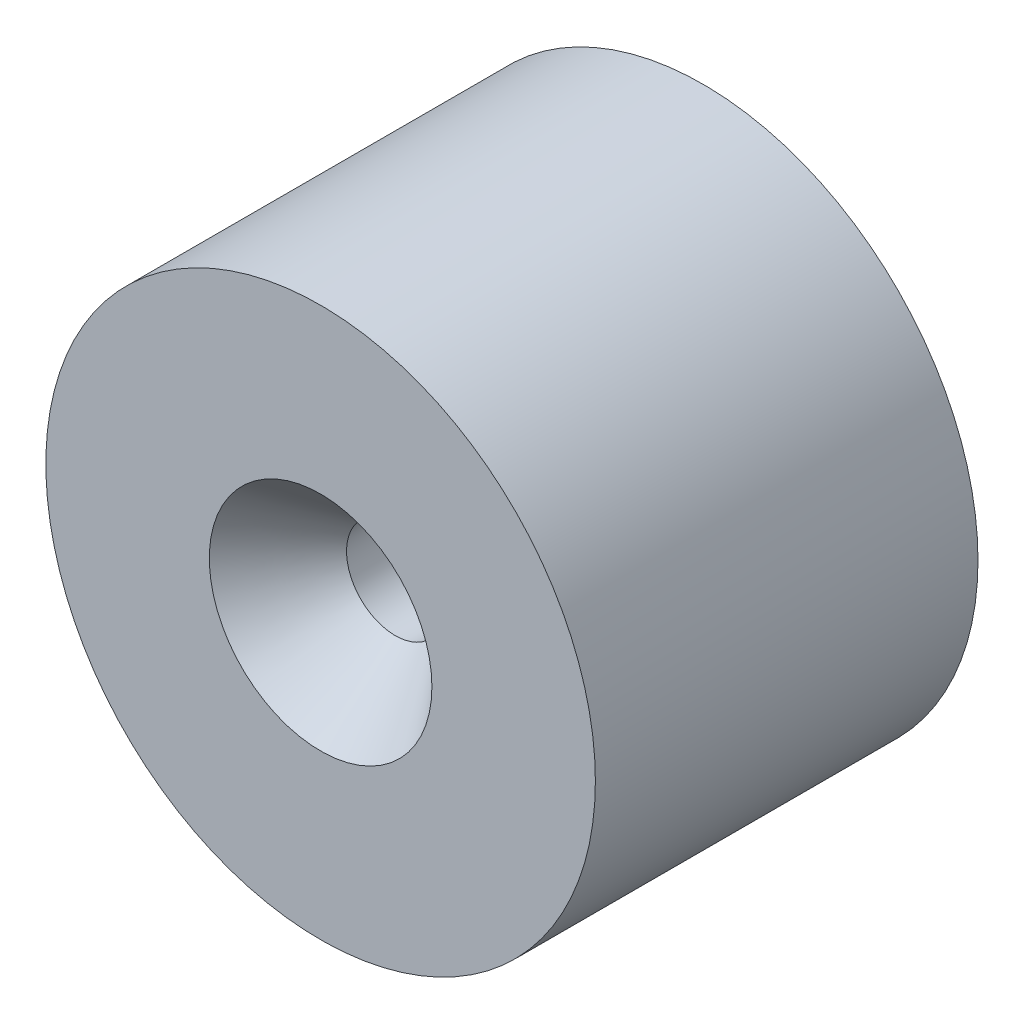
ISO-10303-21;
HEADER;
FILE_DESCRIPTION(('STEP AP214'),'2;1');
FILE_NAME('part.step','',(''),(''),'','','');
FILE_SCHEMA(('AUTOMOTIVE_DESIGN { 1 0 10303 214 1 1 1 1 }'));
ENDSEC;
DATA;
#1=APPLICATION_CONTEXT('core data for automotive mechanical design processes');
#2=APPLICATION_PROTOCOL_DEFINITION('international standard','automotive_design',2000,#1);
#3=PRODUCT_CONTEXT('',#1,'mechanical');
#4=PRODUCT('Part','Part','',(#3));
#5=PRODUCT_RELATED_PRODUCT_CATEGORY('part','',(#4));
#6=PRODUCT_DEFINITION_FORMATION('','',#4);
#7=PRODUCT_DEFINITION_CONTEXT('part definition',#1,'design');
#8=PRODUCT_DEFINITION('design','',#6,#7);
#9=PRODUCT_DEFINITION_SHAPE('','',#8);
#10=(LENGTH_UNIT() NAMED_UNIT(*) SI_UNIT(.MILLI.,.METRE.));
#11=(NAMED_UNIT(*) PLANE_ANGLE_UNIT() SI_UNIT($,.RADIAN.));
#12=(NAMED_UNIT(*) SI_UNIT($,.STERADIAN.) SOLID_ANGLE_UNIT());
#13=UNCERTAINTY_MEASURE_WITH_UNIT(LENGTH_MEASURE(1.E-05),#10,'distance_accuracy_value','');
#14=(GEOMETRIC_REPRESENTATION_CONTEXT(3) GLOBAL_UNCERTAINTY_ASSIGNED_CONTEXT((#13)) GLOBAL_UNIT_ASSIGNED_CONTEXT((#10,
#11,#12)) REPRESENTATION_CONTEXT('',''));
#15=CARTESIAN_POINT('',(0.,0.,0.));
#16=DIRECTION('',(0.,0.,1.));
#17=DIRECTION('',(1.,0.,0.));
#18=AXIS2_PLACEMENT_3D('',#15,#16,#17);
#19=CARTESIAN_POINT('',(0.,0.,11.));
#20=DIRECTION('',(0.,0.,-1.));
#21=DIRECTION('',(-1.,0.,0.));
#22=AXIS2_PLACEMENT_3D('',#19,#20,#21);
#23=CYLINDRICAL_SURFACE('',#22,1.4);
#24=CARTESIAN_POINT('',(0.,0.,0.));
#25=DIRECTION('',(0.,0.,1.));
#26=DIRECTION('',(1.,0.,0.));
#27=AXIS2_PLACEMENT_3D('',#24,#25,#26);
#28=CIRCLE('',#27,1.4);
#29=CARTESIAN_POINT('',(1.4,0.,0.));
#30=VERTEX_POINT('',#29);
#31=EDGE_CURVE('E51',#30,#30,#28,.T.);
#32=ORIENTED_EDGE('',*,*,#31,.F.);
#33=EDGE_LOOP('',(#32));
#34=FACE_BOUND('',#33,.T.);
#35=CARTESIAN_POINT('',(0.,0.,8.85484353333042));
#36=DIRECTION('',(0.,0.,1.));
#37=DIRECTION('',(1.,0.,0.));
#38=AXIS2_PLACEMENT_3D('',#35,#36,#37);
#39=CIRCLE('',#38,1.4);
#40=CARTESIAN_POINT('',(1.4,0.,8.85484353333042));
#41=VERTEX_POINT('',#40);
#42=EDGE_CURVE('E65',#41,#41,#39,.T.);
#43=ORIENTED_EDGE('',*,*,#42,.T.);
#44=EDGE_LOOP('',(#43));
#45=FACE_BOUND('',#44,.T.);
#46=ADVANCED_FACE('F40',(#34,#45),#23,.F.);
#47=CARTESIAN_POINT('',(0.,0.,11.));
#48=DIRECTION('',(0.,0.,1.));
#49=DIRECTION('',(1.,0.,0.));
#50=AXIS2_PLACEMENT_3D('',#47,#48,#49);
#51=PLANE('',#50);
#52=CARTESIAN_POINT('',(0.,0.,11.));
#53=DIRECTION('',(0.,0.,1.));
#54=DIRECTION('',(1.,0.,0.));
#55=AXIS2_PLACEMENT_3D('',#52,#53,#54);
#56=CIRCLE('',#55,3.2);
#57=CARTESIAN_POINT('',(3.2,0.,11.));
#58=VERTEX_POINT('',#57);
#59=EDGE_CURVE('E70',#58,#58,#56,.T.);
#60=ORIENTED_EDGE('',*,*,#59,.F.);
#61=EDGE_LOOP('',(#60));
#62=FACE_BOUND('',#61,.T.);
#63=CARTESIAN_POINT('',(0.,0.,11.));
#64=DIRECTION('',(0.,0.,1.));
#65=DIRECTION('',(1.,0.,0.));
#66=AXIS2_PLACEMENT_3D('',#63,#64,#65);
#67=CIRCLE('',#66,7.9);
#68=CARTESIAN_POINT('',(7.9,0.,11.));
#69=VERTEX_POINT('',#68);
#70=EDGE_CURVE('E11',#69,#69,#67,.T.);
#71=ORIENTED_EDGE('',*,*,#70,.T.);
#72=EDGE_LOOP('',(#71));
#73=FACE_BOUND('',#72,.T.);
#74=ADVANCED_FACE('F76',(#62,#73),#51,.T.);
#75=CARTESIAN_POINT('',(0.,0.,0.));
#76=DIRECTION('',(0.,0.,1.));
#77=DIRECTION('',(1.,0.,0.));
#78=AXIS2_PLACEMENT_3D('',#75,#76,#77);
#79=PLANE('',#78);
#80=CARTESIAN_POINT('',(0.,0.,0.));
#81=DIRECTION('',(0.,0.,1.));
#82=DIRECTION('',(1.,0.,0.));
#83=AXIS2_PLACEMENT_3D('',#80,#81,#82);
#84=CIRCLE('',#83,7.9);
#85=CARTESIAN_POINT('',(7.9,0.,0.));
#86=VERTEX_POINT('',#85);
#87=EDGE_CURVE('E44',#86,#86,#84,.T.);
#88=ORIENTED_EDGE('',*,*,#87,.F.);
#89=EDGE_LOOP('',(#88));
#90=FACE_BOUND('',#89,.T.);
#91=ORIENTED_EDGE('',*,*,#31,.T.);
#92=EDGE_LOOP('',(#91));
#93=FACE_BOUND('',#92,.T.);
#94=ADVANCED_FACE('F78',(#90,#93),#79,.F.);
#95=CARTESIAN_POINT('',(0.,0.,11.));
#96=DIRECTION('',(0.,0.,-1.));
#97=DIRECTION('',(-1.,0.,0.));
#98=AXIS2_PLACEMENT_3D('',#95,#96,#97);
#99=CYLINDRICAL_SURFACE('',#98,7.9);
#100=ORIENTED_EDGE('',*,*,#70,.F.);
#101=EDGE_LOOP('',(#100));
#102=FACE_BOUND('',#101,.T.);
#103=ORIENTED_EDGE('',*,*,#87,.T.);
#104=EDGE_LOOP('',(#103));
#105=FACE_BOUND('',#104,.T.);
#106=ADVANCED_FACE('F42',(#102,#105),#99,.T.);
#107=CARTESIAN_POINT('',(0.,0.,11.));
#108=DIRECTION('',(0.,0.,1.));
#109=DIRECTION('',(1.,0.,0.));
#110=AXIS2_PLACEMENT_3D('',#107,#108,#109);
#111=CONICAL_SURFACE('',#110,3.2,0.698131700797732);
#112=ORIENTED_EDGE('',*,*,#42,.F.);
#113=EDGE_LOOP('',(#112));
#114=FACE_BOUND('',#113,.T.);
#115=ORIENTED_EDGE('',*,*,#59,.T.);
#116=EDGE_LOOP('',(#115));
#117=FACE_BOUND('',#116,.T.);
#118=ADVANCED_FACE('F74',(#114,#117),#111,.F.);
#119=CLOSED_SHELL('',(#46,#74,#94,#106,#118));
#120=CARTESIAN_POINT('',(0.,0.,9.));
#121=DIRECTION('',(0.,0.,-1.));
#122=DIRECTION('',(-1.,0.,0.));
#123=AXIS2_PLACEMENT_3D('',#120,#121,#122);
#124=CYLINDRICAL_SURFACE('',#123,5.3);
#125=CARTESIAN_POINT('',(0.,0.,9.));
#126=DIRECTION('',(0.,0.,-1.));
#127=DIRECTION('',(-1.,0.,0.));
#128=AXIS2_PLACEMENT_3D('',#125,#126,#127);
#129=CIRCLE('',#128,5.3);
#130=CARTESIAN_POINT('',(-5.3,0.,9.));
#131=VERTEX_POINT('',#130);
#132=EDGE_CURVE('E55',#131,#131,#129,.T.);
#133=ORIENTED_EDGE('',*,*,#132,.F.);
#134=EDGE_LOOP('',(#133));
#135=FACE_BOUND('',#134,.T.);
#136=CARTESIAN_POINT('',(0.,0.,2.));
#137=DIRECTION('',(0.,0.,-1.));
#138=DIRECTION('',(-1.,0.,0.));
#139=AXIS2_PLACEMENT_3D('',#136,#137,#138);
#140=CIRCLE('',#139,5.3);
#141=CARTESIAN_POINT('',(-5.3,0.,2.));
#142=VERTEX_POINT('',#141);
#143=EDGE_CURVE('E56',#142,#142,#140,.T.);
#144=ORIENTED_EDGE('',*,*,#143,.T.);
#145=EDGE_LOOP('',(#144));
#146=FACE_BOUND('',#145,.T.);
#147=ADVANCED_FACE('F88',(#135,#146),#124,.F.);
#148=CARTESIAN_POINT('',(0.,0.,9.));
#149=DIRECTION('',(0.,0.,-1.));
#150=DIRECTION('',(-1.,0.,0.));
#151=AXIS2_PLACEMENT_3D('',#148,#149,#150);
#152=PLANE('',#151);
#153=CARTESIAN_POINT('',(0.,0.,9.));
#154=DIRECTION('',(0.,0.,-1.));
#155=DIRECTION('',(-1.,0.,0.));
#156=AXIS2_PLACEMENT_3D('',#153,#154,#155);
#157=CIRCLE('',#156,3.5);
#158=CARTESIAN_POINT('',(-3.5,0.,9.));
#159=VERTEX_POINT('',#158);
#160=EDGE_CURVE('E59',#159,#159,#157,.T.);
#161=ORIENTED_EDGE('',*,*,#160,.F.);
#162=EDGE_LOOP('',(#161));
#163=FACE_BOUND('',#162,.T.);
#164=ORIENTED_EDGE('',*,*,#132,.T.);
#165=EDGE_LOOP('',(#164));
#166=FACE_BOUND('',#165,.T.);
#167=ADVANCED_FACE('F91',(#163,#166),#152,.T.);
#168=CARTESIAN_POINT('',(0.,0.,2.));
#169=DIRECTION('',(0.,0.,-1.));
#170=DIRECTION('',(-1.,0.,0.));
#171=AXIS2_PLACEMENT_3D('',#168,#169,#170);
#172=PLANE('',#171);
#173=CARTESIAN_POINT('',(0.,0.,2.));
#174=DIRECTION('',(0.,0.,-1.));
#175=DIRECTION('',(-1.,0.,0.));
#176=AXIS2_PLACEMENT_3D('',#173,#174,#175);
#177=CIRCLE('',#176,3.5);
#178=CARTESIAN_POINT('',(-3.5,0.,2.));
#179=VERTEX_POINT('',#178);
#180=EDGE_CURVE('E62',#179,#179,#177,.T.);
#181=ORIENTED_EDGE('',*,*,#180,.T.);
#182=EDGE_LOOP('',(#181));
#183=FACE_BOUND('',#182,.T.);
#184=ORIENTED_EDGE('',*,*,#143,.F.);
#185=EDGE_LOOP('',(#184));
#186=FACE_BOUND('',#185,.T.);
#187=ADVANCED_FACE('F94',(#183,#186),#172,.F.);
#188=CARTESIAN_POINT('',(0.,0.,9.));
#189=DIRECTION('',(0.,0.,-1.));
#190=DIRECTION('',(-1.,0.,0.));
#191=AXIS2_PLACEMENT_3D('',#188,#189,#190);
#192=CYLINDRICAL_SURFACE('',#191,3.5);
#193=ORIENTED_EDGE('',*,*,#160,.T.);
#194=EDGE_LOOP('',(#193));
#195=FACE_BOUND('',#194,.T.);
#196=ORIENTED_EDGE('',*,*,#180,.F.);
#197=EDGE_LOOP('',(#196));
#198=FACE_BOUND('',#197,.T.);
#199=ADVANCED_FACE('F97',(#195,#198),#192,.T.);
#200=CLOSED_SHELL('',(#147,#167,#187,#199));
#201=ORIENTED_CLOSED_SHELL('',*,#200,.T.);
#202=BREP_WITH_VOIDS('B2',#119,(#201));
#203=ADVANCED_BREP_SHAPE_REPRESENTATION('',(#18,#202),#14);
#204=SHAPE_DEFINITION_REPRESENTATION(#9,#203);
ENDSEC;
END-ISO-10303-21;
